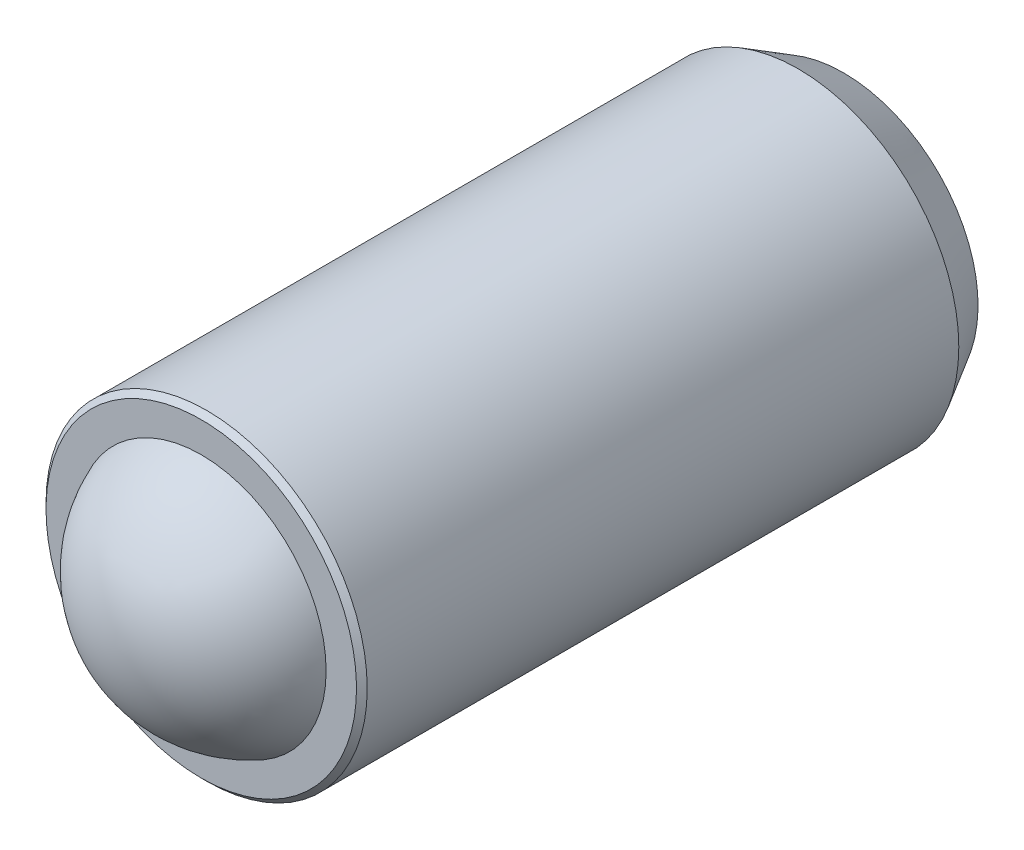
ISO-10303-21;
HEADER;
FILE_DESCRIPTION(('STEP AP214'),'2;1');
FILE_NAME('part.step','',(''),(''),'','','');
FILE_SCHEMA(('AUTOMOTIVE_DESIGN { 1 0 10303 214 1 1 1 1 }'));
ENDSEC;
DATA;
#1=APPLICATION_CONTEXT('core data for automotive mechanical design processes');
#2=APPLICATION_PROTOCOL_DEFINITION('international standard','automotive_design',2000,#1);
#3=PRODUCT_CONTEXT('',#1,'mechanical');
#4=PRODUCT('Part','Part','',(#3));
#5=PRODUCT_RELATED_PRODUCT_CATEGORY('part','',(#4));
#6=PRODUCT_DEFINITION_FORMATION('','',#4);
#7=PRODUCT_DEFINITION_CONTEXT('part definition',#1,'design');
#8=PRODUCT_DEFINITION('design','',#6,#7);
#9=PRODUCT_DEFINITION_SHAPE('','',#8);
#10=(LENGTH_UNIT() NAMED_UNIT(*) SI_UNIT(.MILLI.,.METRE.));
#11=(NAMED_UNIT(*) PLANE_ANGLE_UNIT() SI_UNIT($,.RADIAN.));
#12=(NAMED_UNIT(*) SI_UNIT($,.STERADIAN.) SOLID_ANGLE_UNIT());
#13=UNCERTAINTY_MEASURE_WITH_UNIT(LENGTH_MEASURE(1.E-05),#10,'distance_accuracy_value','');
#14=(GEOMETRIC_REPRESENTATION_CONTEXT(3) GLOBAL_UNCERTAINTY_ASSIGNED_CONTEXT((#13)) GLOBAL_UNIT_ASSIGNED_CONTEXT((#10,
#11,#12)) REPRESENTATION_CONTEXT('',''));
#15=CARTESIAN_POINT('',(0.,0.,0.));
#16=DIRECTION('',(0.,0.,1.));
#17=DIRECTION('',(1.,0.,0.));
#18=AXIS2_PLACEMENT_3D('',#15,#16,#17);
#19=CARTESIAN_POINT('',(0.,0.,0.));
#20=DIRECTION('',(0.,0.,-1.));
#21=DIRECTION('',(0.,1.,0.));
#22=AXIS2_PLACEMENT_3D('',#19,#20,#21);
#23=PLANE('',#22);
#24=CARTESIAN_POINT('',(0.,0.,0.));
#25=DIRECTION('',(0.,0.,-1.));
#26=DIRECTION('',(0.,1.,0.));
#27=AXIS2_PLACEMENT_3D('',#24,#25,#26);
#28=CIRCLE('',#27,5.01850454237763);
#29=CARTESIAN_POINT('',(0.,5.01850454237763,0.));
#30=VERTEX_POINT('',#29);
#31=EDGE_CURVE('E19',#30,#30,#28,.T.);
#32=ORIENTED_EDGE('',*,*,#31,.T.);
#33=EDGE_LOOP('',(#32));
#34=FACE_BOUND('',#33,.T.);
#35=ADVANCED_FACE('F12',(#34),#23,.T.);
#36=CARTESIAN_POINT('',(0.,0.,-5.56770138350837));
#37=DIRECTION('',(0.,0.,-1.));
#38=DIRECTION('',(0.,1.,0.));
#39=AXIS2_PLACEMENT_3D('',#36,#37,#38);
#40=CYLINDRICAL_SURFACE('',#39,6.);
#41=CARTESIAN_POINT('',(0.,0.,1.7));
#42=DIRECTION('',(0.,0.,-1.));
#43=DIRECTION('',(0.,1.,0.));
#44=AXIS2_PLACEMENT_3D('',#41,#42,#43);
#45=CIRCLE('',#44,6.);
#46=CARTESIAN_POINT('',(0.,5.99999999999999,1.70000000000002));
#47=VERTEX_POINT('',#46);
#48=EDGE_CURVE('E8',#47,#47,#45,.F.);
#49=ORIENTED_EDGE('',*,*,#48,.T.);
#50=EDGE_LOOP('',(#49));
#51=FACE_BOUND('',#50,.T.);
#52=CARTESIAN_POINT('',(0.,0.,23.8));
#53=DIRECTION('',(0.,0.,1.));
#54=DIRECTION('',(0.,-1.,0.));
#55=AXIS2_PLACEMENT_3D('',#52,#53,#54);
#56=CIRCLE('',#55,6.);
#57=CARTESIAN_POINT('',(0.,-6.00000000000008,23.8));
#58=VERTEX_POINT('',#57);
#59=EDGE_CURVE('E27',#58,#58,#56,.F.);
#60=ORIENTED_EDGE('',*,*,#59,.T.);
#61=EDGE_LOOP('',(#60));
#62=FACE_BOUND('',#61,.T.);
#63=ADVANCED_FACE('F49',(#51,#62),#40,.T.);
#64=CARTESIAN_POINT('',(6.,0.,24.));
#65=DIRECTION('',(0.,0.,1.));
#66=DIRECTION('',(0.,-1.,0.));
#67=AXIS2_PLACEMENT_3D('',#64,#65,#66);
#68=PLANE('',#67);
#69=CARTESIAN_POINT('',(0.,0.,24.));
#70=DIRECTION('',(0.,0.,1.));
#71=DIRECTION('',(0.,-1.,0.));
#72=AXIS2_PLACEMENT_3D('',#69,#70,#71);
#73=CIRCLE('',#72,5.8);
#74=CARTESIAN_POINT('',(0.,-5.80000000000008,24.));
#75=VERTEX_POINT('',#74);
#76=EDGE_CURVE('E23',#75,#75,#73,.T.);
#77=ORIENTED_EDGE('',*,*,#76,.T.);
#78=EDGE_LOOP('',(#77));
#79=FACE_BOUND('',#78,.T.);
#80=CARTESIAN_POINT('',(0.,0.,24.));
#81=DIRECTION('',(0.,0.,-1.));
#82=DIRECTION('',(0.,1.,0.));
#83=AXIS2_PLACEMENT_3D('',#80,#81,#82);
#84=CIRCLE('',#83,4.66476151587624);
#85=CARTESIAN_POINT('',(0.,4.66476151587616,24.));
#86=VERTEX_POINT('',#85);
#87=EDGE_CURVE('E32',#86,#86,#84,.T.);
#88=ORIENTED_EDGE('',*,*,#87,.T.);
#89=EDGE_LOOP('',(#88));
#90=FACE_BOUND('',#89,.T.);
#91=ADVANCED_FACE('F36',(#79,#90),#68,.T.);
#92=CARTESIAN_POINT('',(0.,0.,22.2));
#93=DIRECTION('',(0.,0.,-1.));
#94=DIRECTION('',(1.,0.,0.));
#95=AXIS2_PLACEMENT_3D('',#92,#93,#94);
#96=SPHERICAL_SURFACE('',#95,5.);
#97=ORIENTED_EDGE('',*,*,#87,.F.);
#98=EDGE_LOOP('',(#97));
#99=FACE_BOUND('',#98,.T.);
#100=ADVANCED_FACE('F38',(#99),#96,.T.);
#101=CARTESIAN_POINT('',(0.,0.,23.8));
#102=DIRECTION('',(0.,0.,-1.));
#103=DIRECTION('',(0.,1.,0.));
#104=AXIS2_PLACEMENT_3D('',#101,#102,#103);
#105=CONICAL_SURFACE('',#104,6.,0.785398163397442);
#106=ORIENTED_EDGE('',*,*,#76,.F.);
#107=EDGE_LOOP('',(#106));
#108=FACE_BOUND('',#107,.T.);
#109=ORIENTED_EDGE('',*,*,#59,.F.);
#110=EDGE_LOOP('',(#109));
#111=FACE_BOUND('',#110,.T.);
#112=ADVANCED_FACE('F40',(#108,#111),#105,.T.);
#113=CARTESIAN_POINT('',(0.,0.,0.));
#114=DIRECTION('',(0.,0.,1.));
#115=DIRECTION('',(0.,-1.,0.));
#116=AXIS2_PLACEMENT_3D('',#113,#114,#115);
#117=CONICAL_SURFACE('',#116,5.01850454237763,0.523598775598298);
#118=ORIENTED_EDGE('',*,*,#48,.F.);
#119=EDGE_LOOP('',(#118));
#120=FACE_BOUND('',#119,.T.);
#121=ORIENTED_EDGE('',*,*,#31,.F.);
#122=EDGE_LOOP('',(#121));
#123=FACE_BOUND('',#122,.T.);
#124=ADVANCED_FACE('F14',(#120,#123),#117,.T.);
#125=CLOSED_SHELL('',(#35,#63,#91,#100,#112,#124));
#126=MANIFOLD_SOLID_BREP('B1',#125);
#127=ADVANCED_BREP_SHAPE_REPRESENTATION('',(#18,#126),#14);
#128=SHAPE_DEFINITION_REPRESENTATION(#9,#127);
ENDSEC;
END-ISO-10303-21;
